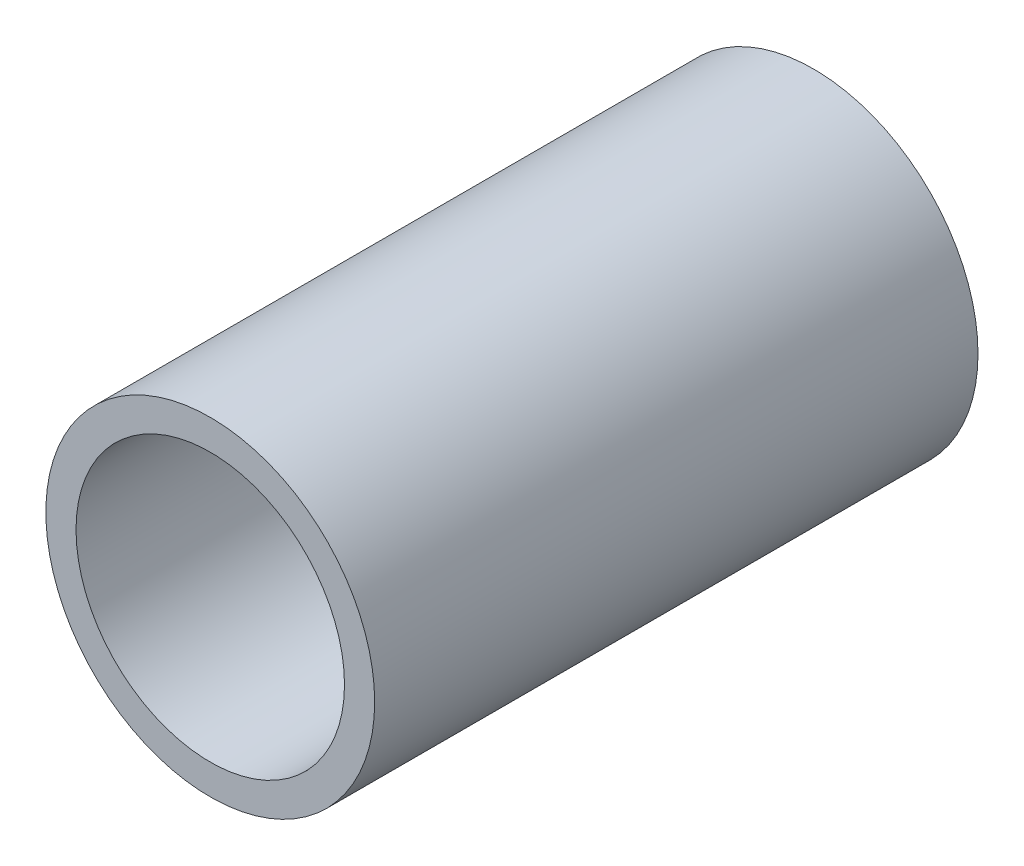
from build123d import *

# Parameters (mm, degrees)
SKETCH1_R           = 34.6075
SKETCH1_R_2         = 28.2575
BOSS_EXTRUDE1_DEPTH = 127


with BuildPart() as part:
    # Sketch1 → Boss-Extrude1 (new body)
    with BuildSketch(Plane.XY):
        Circle(SKETCH1_R)
        Circle(SKETCH1_R_2, mode=Mode.SUBTRACT)
    extrude(amount=BOSS_EXTRUDE1_DEPTH)


solid = part.part
